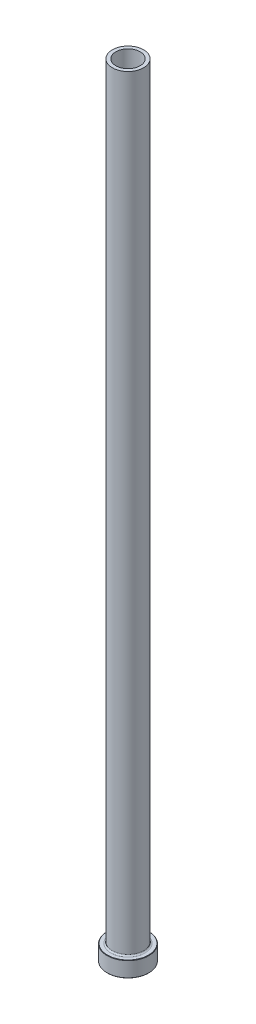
from build123d import *

# Parameters (mm, degrees)
FILLET1_R     = 0.8
CHAMFER1_SIZE = 0.2
CHAMFER3_SIZE = 0.5


with BuildPart() as part:
    # Sketch1 → Revolve1 (revolve)
    with BuildSketch(Plane.XY, mode=Mode.PRIVATE) as revolve1_sk:
        Polygon((-7, 450), (-9, 450), (-9, 9), (-12, 9), (-12, 0), (-7.25, 0), (-7.25, 383), (-7, 395), align=None)
    revolve(revolve1_sk.sketch.rotate(Axis((0, 92.187680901, 0), (0, -1, 0)), 270), axis=Axis((0, 92.187680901, 0), (0, -1, 0)))

    # Fillet1
    fillet1_edges = [part.edges().sort_by_distance(p)[0] for p in [
        (0, 9, -9),
    ]]
    fillet(fillet1_edges, radius=FILLET1_R)

    # Chamfer1
    chamfer1_edges = [part.edges().sort_by_distance(p)[0] for p in [
        (0, 0, -12),
        (0, 9, -12),
    ]]
    chamfer(chamfer1_edges, length=CHAMFER1_SIZE)

    # Chamfer3
    chamfer3_edges = [part.edges().sort_by_distance(p)[0] for p in [
        (0, 0, -7.25),
    ]]
    chamfer(chamfer3_edges, length=CHAMFER3_SIZE)


solid = part.part
